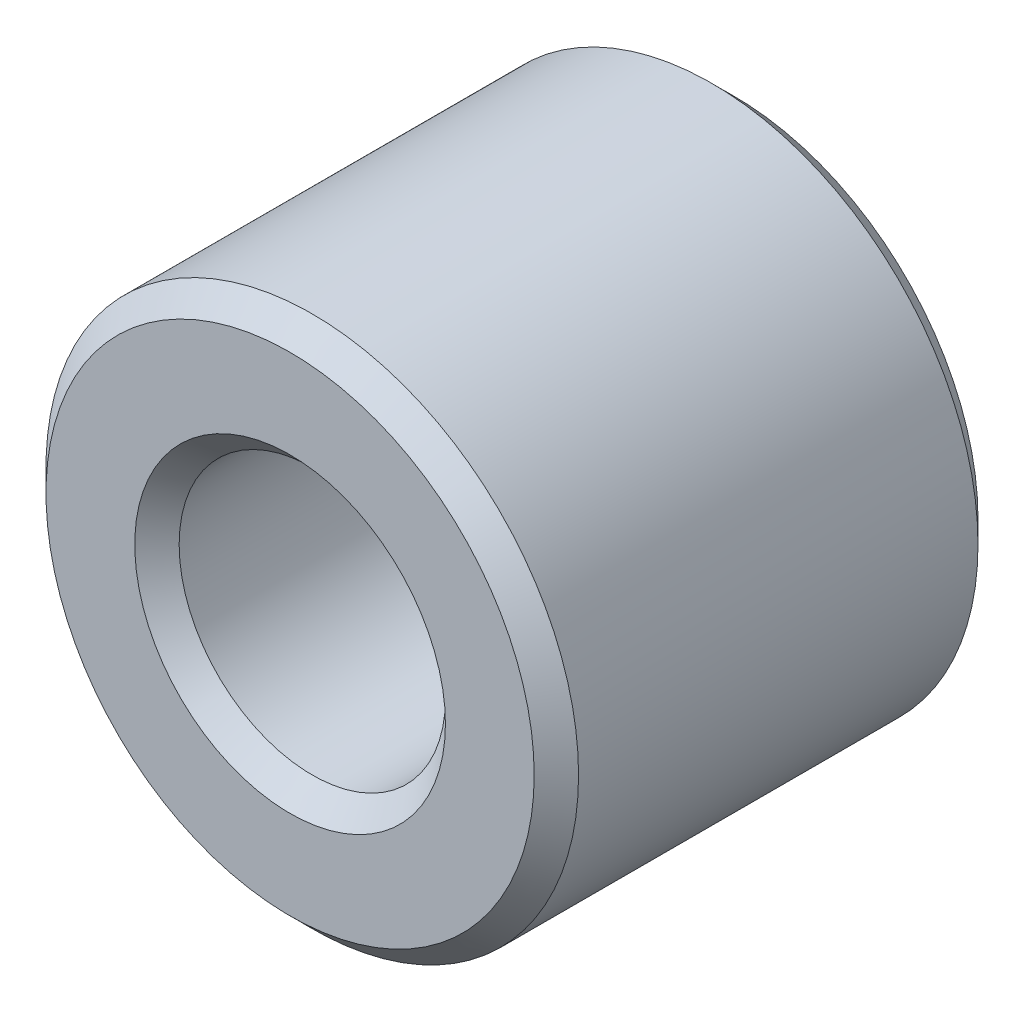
ISO-10303-21;
HEADER;
FILE_DESCRIPTION(('STEP AP214'),'2;1');
FILE_NAME('part.step','',(''),(''),'','','');
FILE_SCHEMA(('AUTOMOTIVE_DESIGN { 1 0 10303 214 1 1 1 1 }'));
ENDSEC;
DATA;
#1=APPLICATION_CONTEXT('core data for automotive mechanical design processes');
#2=APPLICATION_PROTOCOL_DEFINITION('international standard','automotive_design',2000,#1);
#3=PRODUCT_CONTEXT('',#1,'mechanical');
#4=PRODUCT('Part','Part','',(#3));
#5=PRODUCT_RELATED_PRODUCT_CATEGORY('part','',(#4));
#6=PRODUCT_DEFINITION_FORMATION('','',#4);
#7=PRODUCT_DEFINITION_CONTEXT('part definition',#1,'design');
#8=PRODUCT_DEFINITION('design','',#6,#7);
#9=PRODUCT_DEFINITION_SHAPE('','',#8);
#10=(LENGTH_UNIT() NAMED_UNIT(*) SI_UNIT(.MILLI.,.METRE.));
#11=(NAMED_UNIT(*) PLANE_ANGLE_UNIT() SI_UNIT($,.RADIAN.));
#12=(NAMED_UNIT(*) SI_UNIT($,.STERADIAN.) SOLID_ANGLE_UNIT());
#13=UNCERTAINTY_MEASURE_WITH_UNIT(LENGTH_MEASURE(1.E-05),#10,'distance_accuracy_value','');
#14=(GEOMETRIC_REPRESENTATION_CONTEXT(3) GLOBAL_UNCERTAINTY_ASSIGNED_CONTEXT((#13)) GLOBAL_UNIT_ASSIGNED_CONTEXT((#10,
#11,#12)) REPRESENTATION_CONTEXT('',''));
#15=CARTESIAN_POINT('',(0.,0.,0.));
#16=DIRECTION('',(0.,0.,1.));
#17=DIRECTION('',(1.,0.,0.));
#18=AXIS2_PLACEMENT_3D('',#15,#16,#17);
#19=CARTESIAN_POINT('',(0.,0.,2.5));
#20=DIRECTION('',(0.,0.,1.));
#21=DIRECTION('',(1.,0.,0.));
#22=AXIS2_PLACEMENT_3D('',#19,#20,#21);
#23=PLANE('',#22);
#24=CARTESIAN_POINT('',(0.,0.,2.5));
#25=DIRECTION('',(0.,0.,1.));
#26=DIRECTION('',(1.,0.,0.));
#27=AXIS2_PLACEMENT_3D('',#24,#25,#26);
#28=CIRCLE('',#27,2.75);
#29=CARTESIAN_POINT('',(2.75,0.,2.5));
#30=VERTEX_POINT('',#29);
#31=EDGE_CURVE('E26',#30,#30,#28,.T.);
#32=ORIENTED_EDGE('',*,*,#31,.T.);
#33=EDGE_LOOP('',(#32));
#34=FACE_BOUND('',#33,.T.);
#35=CARTESIAN_POINT('',(0.,0.,2.5));
#36=DIRECTION('',(0.,0.,1.));
#37=DIRECTION('',(1.,0.,0.));
#38=AXIS2_PLACEMENT_3D('',#35,#36,#37);
#39=CIRCLE('',#38,1.75);
#40=CARTESIAN_POINT('',(1.75,0.,2.5));
#41=VERTEX_POINT('',#40);
#42=EDGE_CURVE('E30',#41,#41,#39,.F.);
#43=ORIENTED_EDGE('',*,*,#42,.T.);
#44=EDGE_LOOP('',(#43));
#45=FACE_BOUND('',#44,.T.);
#46=ADVANCED_FACE('F15',(#34,#45),#23,.T.);
#47=CARTESIAN_POINT('',(0.,0.,-2.5));
#48=DIRECTION('',(0.,0.,1.));
#49=DIRECTION('',(1.,0.,0.));
#50=AXIS2_PLACEMENT_3D('',#47,#48,#49);
#51=PLANE('',#50);
#52=CARTESIAN_POINT('',(0.,0.,-2.5));
#53=DIRECTION('',(0.,0.,1.));
#54=DIRECTION('',(1.,0.,0.));
#55=AXIS2_PLACEMENT_3D('',#52,#53,#54);
#56=CIRCLE('',#55,2.75);
#57=CARTESIAN_POINT('',(2.75,0.,-2.5));
#58=VERTEX_POINT('',#57);
#59=EDGE_CURVE('E35',#58,#58,#56,.F.);
#60=ORIENTED_EDGE('',*,*,#59,.T.);
#61=EDGE_LOOP('',(#60));
#62=FACE_BOUND('',#61,.T.);
#63=CARTESIAN_POINT('',(0.,0.,-2.5));
#64=DIRECTION('',(0.,0.,1.));
#65=DIRECTION('',(1.,0.,0.));
#66=AXIS2_PLACEMENT_3D('',#63,#64,#65);
#67=CIRCLE('',#66,1.75);
#68=CARTESIAN_POINT('',(1.75,0.,-2.5));
#69=VERTEX_POINT('',#68);
#70=EDGE_CURVE('E38',#69,#69,#67,.T.);
#71=ORIENTED_EDGE('',*,*,#70,.T.);
#72=EDGE_LOOP('',(#71));
#73=FACE_BOUND('',#72,.T.);
#74=ADVANCED_FACE('F59',(#62,#73),#51,.F.);
#75=CARTESIAN_POINT('',(0.,0.,2.5));
#76=DIRECTION('',(0.,0.,-1.));
#77=DIRECTION('',(-1.,0.,0.));
#78=AXIS2_PLACEMENT_3D('',#75,#76,#77);
#79=CYLINDRICAL_SURFACE('',#78,3.);
#80=CARTESIAN_POINT('',(0.,0.,-2.25));
#81=DIRECTION('',(0.,0.,1.));
#82=DIRECTION('',(1.,0.,0.));
#83=AXIS2_PLACEMENT_3D('',#80,#81,#82);
#84=CIRCLE('',#83,3.);
#85=CARTESIAN_POINT('',(3.,0.,-2.25));
#86=VERTEX_POINT('',#85);
#87=EDGE_CURVE('E41',#86,#86,#84,.T.);
#88=ORIENTED_EDGE('',*,*,#87,.T.);
#89=EDGE_LOOP('',(#88));
#90=FACE_BOUND('',#89,.T.);
#91=CARTESIAN_POINT('',(0.,0.,2.25));
#92=DIRECTION('',(0.,0.,1.));
#93=DIRECTION('',(1.,0.,0.));
#94=AXIS2_PLACEMENT_3D('',#91,#92,#93);
#95=CIRCLE('',#94,3.);
#96=CARTESIAN_POINT('',(3.,0.,2.25));
#97=VERTEX_POINT('',#96);
#98=EDGE_CURVE('E44',#97,#97,#95,.F.);
#99=ORIENTED_EDGE('',*,*,#98,.T.);
#100=EDGE_LOOP('',(#99));
#101=FACE_BOUND('',#100,.T.);
#102=ADVANCED_FACE('F17',(#90,#101),#79,.T.);
#103=CARTESIAN_POINT('',(0.,0.,2.5));
#104=DIRECTION('',(0.,0.,-1.));
#105=DIRECTION('',(-1.,0.,0.));
#106=AXIS2_PLACEMENT_3D('',#103,#104,#105);
#107=CYLINDRICAL_SURFACE('',#106,1.5);
#108=CARTESIAN_POINT('',(0.,0.,-2.25));
#109=DIRECTION('',(0.,0.,1.));
#110=DIRECTION('',(1.,0.,0.));
#111=AXIS2_PLACEMENT_3D('',#108,#109,#110);
#112=CIRCLE('',#111,1.5);
#113=CARTESIAN_POINT('',(1.5,0.,-2.25));
#114=VERTEX_POINT('',#113);
#115=EDGE_CURVE('E10',#114,#114,#112,.F.);
#116=ORIENTED_EDGE('',*,*,#115,.T.);
#117=EDGE_LOOP('',(#116));
#118=FACE_BOUND('',#117,.T.);
#119=CARTESIAN_POINT('',(0.,0.,2.25));
#120=DIRECTION('',(0.,0.,1.));
#121=DIRECTION('',(1.,0.,0.));
#122=AXIS2_PLACEMENT_3D('',#119,#120,#121);
#123=CIRCLE('',#122,1.5);
#124=CARTESIAN_POINT('',(1.5,0.,2.25));
#125=VERTEX_POINT('',#124);
#126=EDGE_CURVE('E22',#125,#125,#123,.T.);
#127=ORIENTED_EDGE('',*,*,#126,.T.);
#128=EDGE_LOOP('',(#127));
#129=FACE_BOUND('',#128,.T.);
#130=ADVANCED_FACE('F75',(#118,#129),#107,.F.);
#131=CARTESIAN_POINT('',(0.,0.,-2.25));
#132=DIRECTION('',(0.,0.,1.));
#133=DIRECTION('',(1.,0.,0.));
#134=AXIS2_PLACEMENT_3D('',#131,#132,#133);
#135=CONICAL_SURFACE('',#134,3.,0.78539816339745);
#136=ORIENTED_EDGE('',*,*,#59,.F.);
#137=EDGE_LOOP('',(#136));
#138=FACE_BOUND('',#137,.T.);
#139=ORIENTED_EDGE('',*,*,#87,.F.);
#140=EDGE_LOOP('',(#139));
#141=FACE_BOUND('',#140,.T.);
#142=ADVANCED_FACE('F53',(#138,#141),#135,.T.);
#143=CARTESIAN_POINT('',(0.,0.,2.5));
#144=DIRECTION('',(0.,0.,-1.));
#145=DIRECTION('',(-1.,0.,0.));
#146=AXIS2_PLACEMENT_3D('',#143,#144,#145);
#147=CONICAL_SURFACE('',#146,2.75,0.785398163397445);
#148=ORIENTED_EDGE('',*,*,#98,.F.);
#149=EDGE_LOOP('',(#148));
#150=FACE_BOUND('',#149,.T.);
#151=ORIENTED_EDGE('',*,*,#31,.F.);
#152=EDGE_LOOP('',(#151));
#153=FACE_BOUND('',#152,.T.);
#154=ADVANCED_FACE('F49',(#150,#153),#147,.T.);
#155=CARTESIAN_POINT('',(0.,0.,-2.5));
#156=DIRECTION('',(0.,0.,-1.));
#157=DIRECTION('',(-1.,0.,0.));
#158=AXIS2_PLACEMENT_3D('',#155,#156,#157);
#159=CONICAL_SURFACE('',#158,1.75,0.785398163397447);
#160=ORIENTED_EDGE('',*,*,#115,.F.);
#161=EDGE_LOOP('',(#160));
#162=FACE_BOUND('',#161,.T.);
#163=ORIENTED_EDGE('',*,*,#70,.F.);
#164=EDGE_LOOP('',(#163));
#165=FACE_BOUND('',#164,.T.);
#166=ADVANCED_FACE('F52',(#162,#165),#159,.F.);
#167=CARTESIAN_POINT('',(0.,0.,2.25));
#168=DIRECTION('',(0.,0.,1.));
#169=DIRECTION('',(1.,0.,0.));
#170=AXIS2_PLACEMENT_3D('',#167,#168,#169);
#171=CONICAL_SURFACE('',#170,1.5,0.78539816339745);
#172=ORIENTED_EDGE('',*,*,#42,.F.);
#173=EDGE_LOOP('',(#172));
#174=FACE_BOUND('',#173,.T.);
#175=ORIENTED_EDGE('',*,*,#126,.F.);
#176=EDGE_LOOP('',(#175));
#177=FACE_BOUND('',#176,.T.);
#178=ADVANCED_FACE('F62',(#174,#177),#171,.F.);
#179=CLOSED_SHELL('',(#46,#74,#102,#130,#142,#154,#166,#178));
#180=MANIFOLD_SOLID_BREP('B1',#179);
#181=ADVANCED_BREP_SHAPE_REPRESENTATION('',(#18,#180),#14);
#182=SHAPE_DEFINITION_REPRESENTATION(#9,#181);
ENDSEC;
END-ISO-10303-21;
